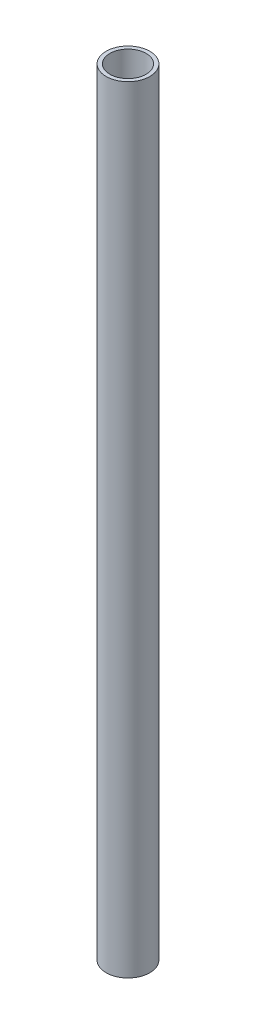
ISO-10303-21;
HEADER;
FILE_DESCRIPTION(('STEP AP214'),'2;1');
FILE_NAME('part.step','',(''),(''),'','','');
FILE_SCHEMA(('AUTOMOTIVE_DESIGN { 1 0 10303 214 1 1 1 1 }'));
ENDSEC;
DATA;
#1=APPLICATION_CONTEXT('core data for automotive mechanical design processes');
#2=APPLICATION_PROTOCOL_DEFINITION('international standard','automotive_design',2000,#1);
#3=PRODUCT_CONTEXT('',#1,'mechanical');
#4=PRODUCT('Part','Part','',(#3));
#5=PRODUCT_RELATED_PRODUCT_CATEGORY('part','',(#4));
#6=PRODUCT_DEFINITION_FORMATION('','',#4);
#7=PRODUCT_DEFINITION_CONTEXT('part definition',#1,'design');
#8=PRODUCT_DEFINITION('design','',#6,#7);
#9=PRODUCT_DEFINITION_SHAPE('','',#8);
#10=(LENGTH_UNIT() NAMED_UNIT(*) SI_UNIT(.MILLI.,.METRE.));
#11=(NAMED_UNIT(*) PLANE_ANGLE_UNIT() SI_UNIT($,.RADIAN.));
#12=(NAMED_UNIT(*) SI_UNIT($,.STERADIAN.) SOLID_ANGLE_UNIT());
#13=UNCERTAINTY_MEASURE_WITH_UNIT(LENGTH_MEASURE(1.E-05),#10,'distance_accuracy_value','');
#14=(GEOMETRIC_REPRESENTATION_CONTEXT(3) GLOBAL_UNCERTAINTY_ASSIGNED_CONTEXT((#13)) GLOBAL_UNIT_ASSIGNED_CONTEXT((#10,
#11,#12)) REPRESENTATION_CONTEXT('',''));
#15=CARTESIAN_POINT('',(0.,0.,0.));
#16=DIRECTION('',(0.,0.,1.));
#17=DIRECTION('',(1.,0.,0.));
#18=AXIS2_PLACEMENT_3D('',#15,#16,#17);
#19=CARTESIAN_POINT('',(0.,-381.,0.));
#20=DIRECTION('',(0.,1.,0.));
#21=DIRECTION('',(0.,0.,1.));
#22=AXIS2_PLACEMENT_3D('',#19,#20,#21);
#23=CYLINDRICAL_SURFACE('',#22,10.7315);
#24=CARTESIAN_POINT('',(0.,-381.,0.));
#25=DIRECTION('',(0.,1.,0.));
#26=DIRECTION('',(0.,0.,1.));
#27=AXIS2_PLACEMENT_3D('',#24,#25,#26);
#28=CIRCLE('',#27,10.7315);
#29=CARTESIAN_POINT('',(0.,-381.,10.7315));
#30=VERTEX_POINT('',#29);
#31=EDGE_CURVE('E10',#30,#30,#28,.T.);
#32=ORIENTED_EDGE('',*,*,#31,.T.);
#33=EDGE_LOOP('',(#32));
#34=FACE_BOUND('',#33,.T.);
#35=CARTESIAN_POINT('',(0.,0.,0.));
#36=DIRECTION('',(0.,1.,0.));
#37=DIRECTION('',(0.,0.,1.));
#38=AXIS2_PLACEMENT_3D('',#35,#36,#37);
#39=CIRCLE('',#38,10.7315);
#40=CARTESIAN_POINT('',(0.,0.,10.7315));
#41=VERTEX_POINT('',#40);
#42=EDGE_CURVE('E38',#41,#41,#39,.T.);
#43=ORIENTED_EDGE('',*,*,#42,.F.);
#44=EDGE_LOOP('',(#43));
#45=FACE_BOUND('',#44,.T.);
#46=ADVANCED_FACE('F32',(#34,#45),#23,.T.);
#47=CARTESIAN_POINT('',(0.,-381.,0.));
#48=DIRECTION('',(0.,1.,0.));
#49=DIRECTION('',(0.,0.,1.));
#50=AXIS2_PLACEMENT_3D('',#47,#48,#49);
#51=PLANE('',#50);
#52=CARTESIAN_POINT('',(0.,-381.,0.));
#53=DIRECTION('',(0.,1.,0.));
#54=DIRECTION('',(0.,0.,1.));
#55=AXIS2_PLACEMENT_3D('',#52,#53,#54);
#56=CIRCLE('',#55,8.89);
#57=CARTESIAN_POINT('',(0.,-381.,8.89));
#58=VERTEX_POINT('',#57);
#59=EDGE_CURVE('E42',#58,#58,#56,.T.);
#60=ORIENTED_EDGE('',*,*,#59,.T.);
#61=EDGE_LOOP('',(#60));
#62=FACE_BOUND('',#61,.T.);
#63=ORIENTED_EDGE('',*,*,#31,.F.);
#64=EDGE_LOOP('',(#63));
#65=FACE_BOUND('',#64,.T.);
#66=ADVANCED_FACE('F56',(#62,#65),#51,.F.);
#67=CARTESIAN_POINT('',(0.,0.,0.));
#68=DIRECTION('',(0.,1.,0.));
#69=DIRECTION('',(0.,0.,1.));
#70=AXIS2_PLACEMENT_3D('',#67,#68,#69);
#71=PLANE('',#70);
#72=CARTESIAN_POINT('',(0.,0.,0.));
#73=DIRECTION('',(0.,1.,0.));
#74=DIRECTION('',(0.,0.,1.));
#75=AXIS2_PLACEMENT_3D('',#72,#73,#74);
#76=CIRCLE('',#75,8.89);
#77=CARTESIAN_POINT('',(0.,0.,8.89));
#78=VERTEX_POINT('',#77);
#79=EDGE_CURVE('E46',#78,#78,#76,.T.);
#80=ORIENTED_EDGE('',*,*,#79,.F.);
#81=EDGE_LOOP('',(#80));
#82=FACE_BOUND('',#81,.T.);
#83=ORIENTED_EDGE('',*,*,#42,.T.);
#84=EDGE_LOOP('',(#83));
#85=FACE_BOUND('',#84,.T.);
#86=ADVANCED_FACE('F54',(#82,#85),#71,.T.);
#87=CARTESIAN_POINT('',(0.,-381.,0.));
#88=DIRECTION('',(0.,1.,0.));
#89=DIRECTION('',(0.,0.,1.));
#90=AXIS2_PLACEMENT_3D('',#87,#88,#89);
#91=CYLINDRICAL_SURFACE('',#90,8.89);
#92=ORIENTED_EDGE('',*,*,#59,.F.);
#93=EDGE_LOOP('',(#92));
#94=FACE_BOUND('',#93,.T.);
#95=ORIENTED_EDGE('',*,*,#79,.T.);
#96=EDGE_LOOP('',(#95));
#97=FACE_BOUND('',#96,.T.);
#98=ADVANCED_FACE('F52',(#94,#97),#91,.F.);
#99=CLOSED_SHELL('',(#46,#66,#86,#98));
#100=MANIFOLD_SOLID_BREP('B2',#99);
#101=ADVANCED_BREP_SHAPE_REPRESENTATION('',(#18,#100),#14);
#102=SHAPE_DEFINITION_REPRESENTATION(#9,#101);
ENDSEC;
END-ISO-10303-21;
